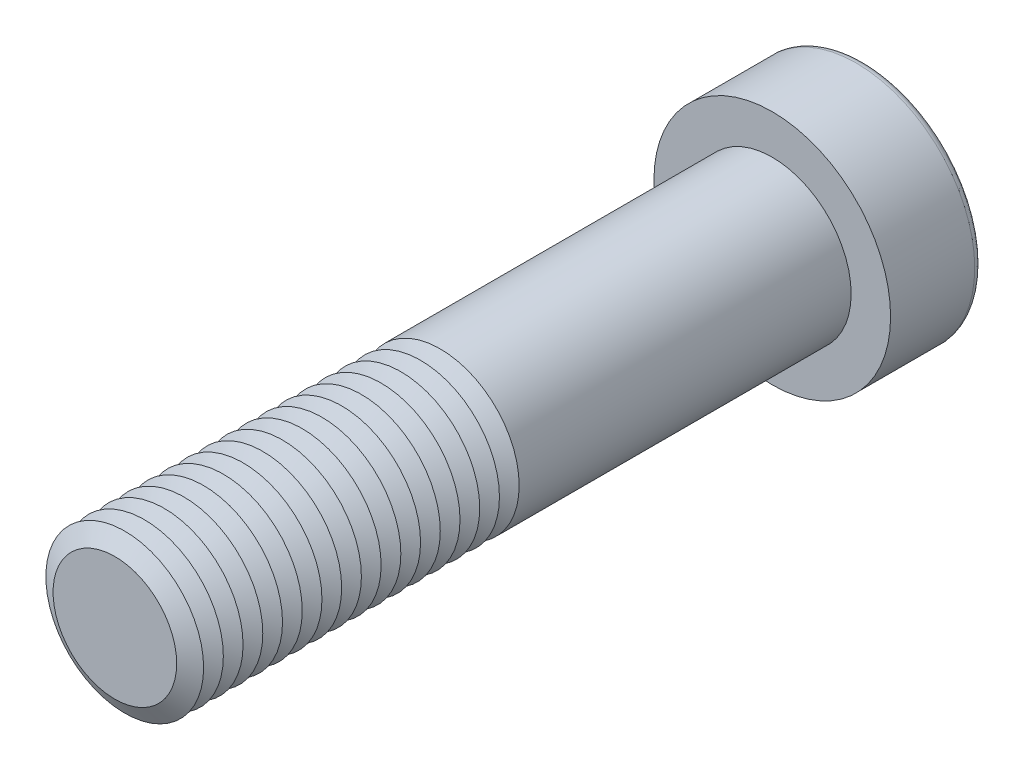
ISO-10303-21;
HEADER;
FILE_DESCRIPTION(('STEP AP214'),'2;1');
FILE_NAME('part.step','',(''),(''),'','','');
FILE_SCHEMA(('AUTOMOTIVE_DESIGN { 1 0 10303 214 1 1 1 1 }'));
ENDSEC;
DATA;
#1=APPLICATION_CONTEXT('core data for automotive mechanical design processes');
#2=APPLICATION_PROTOCOL_DEFINITION('international standard','automotive_design',2000,#1);
#3=PRODUCT_CONTEXT('',#1,'mechanical');
#4=PRODUCT('Part','Part','',(#3));
#5=PRODUCT_RELATED_PRODUCT_CATEGORY('part','',(#4));
#6=PRODUCT_DEFINITION_FORMATION('','',#4);
#7=PRODUCT_DEFINITION_CONTEXT('part definition',#1,'design');
#8=PRODUCT_DEFINITION('design','',#6,#7);
#9=PRODUCT_DEFINITION_SHAPE('','',#8);
#10=(LENGTH_UNIT() NAMED_UNIT(*) SI_UNIT(.MILLI.,.METRE.));
#11=(NAMED_UNIT(*) PLANE_ANGLE_UNIT() SI_UNIT($,.RADIAN.));
#12=(NAMED_UNIT(*) SI_UNIT($,.STERADIAN.) SOLID_ANGLE_UNIT());
#13=UNCERTAINTY_MEASURE_WITH_UNIT(LENGTH_MEASURE(1.E-05),#10,'distance_accuracy_value','');
#14=(GEOMETRIC_REPRESENTATION_CONTEXT(3) GLOBAL_UNCERTAINTY_ASSIGNED_CONTEXT((#13)) GLOBAL_UNIT_ASSIGNED_CONTEXT((#10,
#11,#12)) REPRESENTATION_CONTEXT('',''));
#15=CARTESIAN_POINT('',(0.,0.,0.));
#16=DIRECTION('',(0.,0.,1.));
#17=DIRECTION('',(1.,0.,0.));
#18=AXIS2_PLACEMENT_3D('',#15,#16,#17);
#19=CARTESIAN_POINT('',(0.,0.,89.5));
#20=DIRECTION('',(0.,0.,1.));
#21=DIRECTION('',(1.,0.,0.));
#22=AXIS2_PLACEMENT_3D('',#19,#20,#21);
#23=CONICAL_SURFACE('',#22,12.,1.0471975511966);
#24=CARTESIAN_POINT('',(0.,0.,88.));
#25=DIRECTION('',(0.,0.,1.));
#26=DIRECTION('',(1.,0.,0.));
#27=AXIS2_PLACEMENT_3D('',#24,#25,#26);
#28=CIRCLE('',#27,9.40192378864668);
#29=CARTESIAN_POINT('',(9.40192378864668,0.,88.));
#30=VERTEX_POINT('',#29);
#31=EDGE_CURVE('E313',#30,#30,#28,.T.);
#32=ORIENTED_EDGE('',*,*,#31,.T.);
#33=EDGE_LOOP('',(#32));
#34=FACE_BOUND('',#33,.T.);
#35=CARTESIAN_POINT('',(0.,0.,89.5));
#36=DIRECTION('',(0.,0.,1.));
#37=DIRECTION('',(1.,0.,0.));
#38=AXIS2_PLACEMENT_3D('',#35,#36,#37);
#39=CIRCLE('',#38,12.);
#40=CARTESIAN_POINT('',(12.,0.,89.5));
#41=VERTEX_POINT('',#40);
#42=EDGE_CURVE('E316',#41,#41,#39,.T.);
#43=ORIENTED_EDGE('',*,*,#42,.F.);
#44=EDGE_LOOP('',(#43));
#45=FACE_BOUND('',#44,.T.);
#46=ADVANCED_FACE('F39',(#34,#45),#23,.T.);
#47=CARTESIAN_POINT('',(0.,0.,88.));
#48=DIRECTION('',(0.,0.,-1.));
#49=DIRECTION('',(-1.,0.,0.));
#50=AXIS2_PLACEMENT_3D('',#47,#48,#49);
#51=CONICAL_SURFACE('',#50,9.40192378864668,1.0471975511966);
#52=CARTESIAN_POINT('',(0.,0.,86.5));
#53=DIRECTION('',(0.,0.,1.));
#54=DIRECTION('',(1.,0.,0.));
#55=AXIS2_PLACEMENT_3D('',#52,#53,#54);
#56=CIRCLE('',#55,12.);
#57=CARTESIAN_POINT('',(12.,0.,86.5));
#58=VERTEX_POINT('',#57);
#59=EDGE_CURVE('E324',#58,#58,#56,.T.);
#60=ORIENTED_EDGE('',*,*,#59,.T.);
#61=EDGE_LOOP('',(#60));
#62=FACE_BOUND('',#61,.T.);
#63=ORIENTED_EDGE('',*,*,#31,.F.);
#64=EDGE_LOOP('',(#63));
#65=FACE_BOUND('',#64,.T.);
#66=ADVANCED_FACE('F245',(#62,#65),#51,.T.);
#67=CARTESIAN_POINT('',(0.,0.,100.));
#68=DIRECTION('',(0.,0.,1.));
#69=DIRECTION('',(1.,0.,0.));
#70=AXIS2_PLACEMENT_3D('',#67,#68,#69);
#71=PLANE('',#70);
#72=CARTESIAN_POINT('',(0.,0.,100.));
#73=DIRECTION('',(0.,0.,1.));
#74=DIRECTION('',(1.,0.,0.));
#75=AXIS2_PLACEMENT_3D('',#72,#73,#74);
#76=CIRCLE('',#75,9.40192378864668);
#77=CARTESIAN_POINT('',(9.40192378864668,0.,100.));
#78=VERTEX_POINT('',#77);
#79=EDGE_CURVE('E174',#78,#78,#76,.T.);
#80=ORIENTED_EDGE('',*,*,#79,.T.);
#81=EDGE_LOOP('',(#80));
#82=FACE_BOUND('',#81,.T.);
#83=ADVANCED_FACE('F251',(#82),#71,.T.);
#84=CARTESIAN_POINT('',(0.,0.,100.));
#85=DIRECTION('',(0.,0.,-1.));
#86=DIRECTION('',(-1.,0.,0.));
#87=AXIS2_PLACEMENT_3D('',#84,#85,#86);
#88=CONICAL_SURFACE('',#87,9.40192378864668,1.0471975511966);
#89=CARTESIAN_POINT('',(0.,0.,98.5));
#90=DIRECTION('',(0.,0.,1.));
#91=DIRECTION('',(1.,0.,0.));
#92=AXIS2_PLACEMENT_3D('',#89,#90,#91);
#93=CIRCLE('',#92,12.);
#94=CARTESIAN_POINT('',(12.,0.,98.5));
#95=VERTEX_POINT('',#94);
#96=EDGE_CURVE('E291',#95,#95,#93,.T.);
#97=ORIENTED_EDGE('',*,*,#96,.T.);
#98=EDGE_LOOP('',(#97));
#99=FACE_BOUND('',#98,.T.);
#100=ORIENTED_EDGE('',*,*,#79,.F.);
#101=EDGE_LOOP('',(#100));
#102=FACE_BOUND('',#101,.T.);
#103=ADVANCED_FACE('F199',(#99,#102),#88,.T.);
#104=CARTESIAN_POINT('',(0.,0.,98.5));
#105=DIRECTION('',(0.,0.,1.));
#106=DIRECTION('',(1.,0.,0.));
#107=AXIS2_PLACEMENT_3D('',#104,#105,#106);
#108=CONICAL_SURFACE('',#107,12.,1.0471975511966);
#109=CARTESIAN_POINT('',(0.,0.,97.));
#110=DIRECTION('',(0.,0.,1.));
#111=DIRECTION('',(1.,0.,0.));
#112=AXIS2_PLACEMENT_3D('',#109,#110,#111);
#113=CIRCLE('',#112,9.40192378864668);
#114=CARTESIAN_POINT('',(9.40192378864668,0.,97.));
#115=VERTEX_POINT('',#114);
#116=EDGE_CURVE('E288',#115,#115,#113,.T.);
#117=ORIENTED_EDGE('',*,*,#116,.T.);
#118=EDGE_LOOP('',(#117));
#119=FACE_BOUND('',#118,.T.);
#120=ORIENTED_EDGE('',*,*,#96,.F.);
#121=EDGE_LOOP('',(#120));
#122=FACE_BOUND('',#121,.T.);
#123=ADVANCED_FACE('F277',(#119,#122),#108,.T.);
#124=CARTESIAN_POINT('',(0.,0.,97.));
#125=DIRECTION('',(0.,0.,-1.));
#126=DIRECTION('',(-1.,0.,0.));
#127=AXIS2_PLACEMENT_3D('',#124,#125,#126);
#128=CONICAL_SURFACE('',#127,9.40192378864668,1.0471975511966);
#129=CARTESIAN_POINT('',(0.,0.,95.5));
#130=DIRECTION('',(0.,0.,1.));
#131=DIRECTION('',(1.,0.,0.));
#132=AXIS2_PLACEMENT_3D('',#129,#130,#131);
#133=CIRCLE('',#132,12.);
#134=CARTESIAN_POINT('',(12.,0.,95.5));
#135=VERTEX_POINT('',#134);
#136=EDGE_CURVE('E300',#135,#135,#133,.T.);
#137=ORIENTED_EDGE('',*,*,#136,.T.);
#138=EDGE_LOOP('',(#137));
#139=FACE_BOUND('',#138,.T.);
#140=ORIENTED_EDGE('',*,*,#116,.F.);
#141=EDGE_LOOP('',(#140));
#142=FACE_BOUND('',#141,.T.);
#143=ADVANCED_FACE('F274',(#139,#142),#128,.T.);
#144=CARTESIAN_POINT('',(0.,0.,95.5));
#145=DIRECTION('',(0.,0.,1.));
#146=DIRECTION('',(1.,0.,0.));
#147=AXIS2_PLACEMENT_3D('',#144,#145,#146);
#148=CONICAL_SURFACE('',#147,12.,1.0471975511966);
#149=CARTESIAN_POINT('',(0.,0.,94.));
#150=DIRECTION('',(0.,0.,1.));
#151=DIRECTION('',(1.,0.,0.));
#152=AXIS2_PLACEMENT_3D('',#149,#150,#151);
#153=CIRCLE('',#152,9.40192378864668);
#154=CARTESIAN_POINT('',(9.40192378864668,0.,94.));
#155=VERTEX_POINT('',#154);
#156=EDGE_CURVE('E293',#155,#155,#153,.T.);
#157=ORIENTED_EDGE('',*,*,#156,.T.);
#158=EDGE_LOOP('',(#157));
#159=FACE_BOUND('',#158,.T.);
#160=ORIENTED_EDGE('',*,*,#136,.F.);
#161=EDGE_LOOP('',(#160));
#162=FACE_BOUND('',#161,.T.);
#163=ADVANCED_FACE('F270',(#159,#162),#148,.T.);
#164=CARTESIAN_POINT('',(0.,0.,94.));
#165=DIRECTION('',(0.,0.,-1.));
#166=DIRECTION('',(-1.,0.,0.));
#167=AXIS2_PLACEMENT_3D('',#164,#165,#166);
#168=CONICAL_SURFACE('',#167,9.40192378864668,1.0471975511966);
#169=CARTESIAN_POINT('',(0.,0.,92.5));
#170=DIRECTION('',(0.,0.,1.));
#171=DIRECTION('',(1.,0.,0.));
#172=AXIS2_PLACEMENT_3D('',#169,#170,#171);
#173=CIRCLE('',#172,12.);
#174=CARTESIAN_POINT('',(12.,0.,92.5));
#175=VERTEX_POINT('',#174);
#176=EDGE_CURVE('E310',#175,#175,#173,.T.);
#177=ORIENTED_EDGE('',*,*,#176,.T.);
#178=EDGE_LOOP('',(#177));
#179=FACE_BOUND('',#178,.T.);
#180=ORIENTED_EDGE('',*,*,#156,.F.);
#181=EDGE_LOOP('',(#180));
#182=FACE_BOUND('',#181,.T.);
#183=ADVANCED_FACE('F266',(#179,#182),#168,.T.);
#184=CARTESIAN_POINT('',(0.,0.,92.5));
#185=DIRECTION('',(0.,0.,1.));
#186=DIRECTION('',(1.,0.,0.));
#187=AXIS2_PLACEMENT_3D('',#184,#185,#186);
#188=CONICAL_SURFACE('',#187,12.,1.0471975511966);
#189=CARTESIAN_POINT('',(0.,0.,91.));
#190=DIRECTION('',(0.,0.,1.));
#191=DIRECTION('',(1.,0.,0.));
#192=AXIS2_PLACEMENT_3D('',#189,#190,#191);
#193=CIRCLE('',#192,9.40192378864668);
#194=CARTESIAN_POINT('',(9.40192378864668,0.,91.));
#195=VERTEX_POINT('',#194);
#196=EDGE_CURVE('E306',#195,#195,#193,.T.);
#197=ORIENTED_EDGE('',*,*,#196,.T.);
#198=EDGE_LOOP('',(#197));
#199=FACE_BOUND('',#198,.T.);
#200=ORIENTED_EDGE('',*,*,#176,.F.);
#201=EDGE_LOOP('',(#200));
#202=FACE_BOUND('',#201,.T.);
#203=ADVANCED_FACE('F262',(#199,#202),#188,.T.);
#204=CARTESIAN_POINT('',(0.,0.,91.));
#205=DIRECTION('',(0.,0.,-1.));
#206=DIRECTION('',(-1.,0.,0.));
#207=AXIS2_PLACEMENT_3D('',#204,#205,#206);
#208=CONICAL_SURFACE('',#207,9.40192378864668,1.0471975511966);
#209=ORIENTED_EDGE('',*,*,#42,.T.);
#210=EDGE_LOOP('',(#209));
#211=FACE_BOUND('',#210,.T.);
#212=ORIENTED_EDGE('',*,*,#196,.F.);
#213=EDGE_LOOP('',(#212));
#214=FACE_BOUND('',#213,.T.);
#215=ADVANCED_FACE('F258',(#211,#214),#208,.T.);
#216=CARTESIAN_POINT('',(0.,0.,86.5));
#217=DIRECTION('',(0.,0.,1.));
#218=DIRECTION('',(1.,0.,0.));
#219=AXIS2_PLACEMENT_3D('',#216,#217,#218);
#220=CONICAL_SURFACE('',#219,12.,1.0471975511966);
#221=CARTESIAN_POINT('',(0.,0.,85.));
#222=DIRECTION('',(0.,0.,1.));
#223=DIRECTION('',(1.,0.,0.));
#224=AXIS2_PLACEMENT_3D('',#221,#222,#223);
#225=CIRCLE('',#224,9.40192378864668);
#226=CARTESIAN_POINT('',(9.40192378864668,0.,85.));
#227=VERTEX_POINT('',#226);
#228=EDGE_CURVE('E320',#227,#227,#225,.T.);
#229=ORIENTED_EDGE('',*,*,#228,.T.);
#230=EDGE_LOOP('',(#229));
#231=FACE_BOUND('',#230,.T.);
#232=ORIENTED_EDGE('',*,*,#59,.F.);
#233=EDGE_LOOP('',(#232));
#234=FACE_BOUND('',#233,.T.);
#235=ADVANCED_FACE('F261',(#231,#234),#220,.T.);
#236=CARTESIAN_POINT('',(0.,0.,85.));
#237=DIRECTION('',(0.,0.,-1.));
#238=DIRECTION('',(-1.,0.,0.));
#239=AXIS2_PLACEMENT_3D('',#236,#237,#238);
#240=CONICAL_SURFACE('',#239,9.40192378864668,1.0471975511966);
#241=CARTESIAN_POINT('',(0.,0.,83.5));
#242=DIRECTION('',(0.,0.,1.));
#243=DIRECTION('',(1.,0.,0.));
#244=AXIS2_PLACEMENT_3D('',#241,#242,#243);
#245=CIRCLE('',#244,12.);
#246=CARTESIAN_POINT('',(12.,0.,83.5));
#247=VERTEX_POINT('',#246);
#248=EDGE_CURVE('E332',#247,#247,#245,.T.);
#249=ORIENTED_EDGE('',*,*,#248,.T.);
#250=EDGE_LOOP('',(#249));
#251=FACE_BOUND('',#250,.T.);
#252=ORIENTED_EDGE('',*,*,#228,.F.);
#253=EDGE_LOOP('',(#252));
#254=FACE_BOUND('',#253,.T.);
#255=ADVANCED_FACE('F512',(#251,#254),#240,.T.);
#256=CARTESIAN_POINT('',(0.,0.,83.5));
#257=DIRECTION('',(0.,0.,1.));
#258=DIRECTION('',(1.,0.,0.));
#259=AXIS2_PLACEMENT_3D('',#256,#257,#258);
#260=CONICAL_SURFACE('',#259,12.,1.0471975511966);
#261=CARTESIAN_POINT('',(0.,0.,82.));
#262=DIRECTION('',(0.,0.,1.));
#263=DIRECTION('',(1.,0.,0.));
#264=AXIS2_PLACEMENT_3D('',#261,#262,#263);
#265=CIRCLE('',#264,9.40192378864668);
#266=CARTESIAN_POINT('',(9.40192378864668,0.,82.));
#267=VERTEX_POINT('',#266);
#268=EDGE_CURVE('E328',#267,#267,#265,.T.);
#269=ORIENTED_EDGE('',*,*,#268,.T.);
#270=EDGE_LOOP('',(#269));
#271=FACE_BOUND('',#270,.T.);
#272=ORIENTED_EDGE('',*,*,#248,.F.);
#273=EDGE_LOOP('',(#272));
#274=FACE_BOUND('',#273,.T.);
#275=ADVANCED_FACE('F508',(#271,#274),#260,.T.);
#276=CARTESIAN_POINT('',(0.,0.,82.));
#277=DIRECTION('',(0.,0.,-1.));
#278=DIRECTION('',(-1.,0.,0.));
#279=AXIS2_PLACEMENT_3D('',#276,#277,#278);
#280=CONICAL_SURFACE('',#279,9.40192378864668,1.0471975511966);
#281=CARTESIAN_POINT('',(0.,0.,80.5));
#282=DIRECTION('',(0.,0.,1.));
#283=DIRECTION('',(1.,0.,0.));
#284=AXIS2_PLACEMENT_3D('',#281,#282,#283);
#285=CIRCLE('',#284,12.);
#286=CARTESIAN_POINT('',(12.,0.,80.5));
#287=VERTEX_POINT('',#286);
#288=EDGE_CURVE('E340',#287,#287,#285,.T.);
#289=ORIENTED_EDGE('',*,*,#288,.T.);
#290=EDGE_LOOP('',(#289));
#291=FACE_BOUND('',#290,.T.);
#292=ORIENTED_EDGE('',*,*,#268,.F.);
#293=EDGE_LOOP('',(#292));
#294=FACE_BOUND('',#293,.T.);
#295=ADVANCED_FACE('F504',(#291,#294),#280,.T.);
#296=CARTESIAN_POINT('',(0.,0.,80.5));
#297=DIRECTION('',(0.,0.,1.));
#298=DIRECTION('',(1.,0.,0.));
#299=AXIS2_PLACEMENT_3D('',#296,#297,#298);
#300=CONICAL_SURFACE('',#299,12.,1.0471975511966);
#301=CARTESIAN_POINT('',(0.,0.,79.));
#302=DIRECTION('',(0.,0.,1.));
#303=DIRECTION('',(1.,0.,0.));
#304=AXIS2_PLACEMENT_3D('',#301,#302,#303);
#305=CIRCLE('',#304,9.40192378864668);
#306=CARTESIAN_POINT('',(9.40192378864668,0.,79.));
#307=VERTEX_POINT('',#306);
#308=EDGE_CURVE('E336',#307,#307,#305,.T.);
#309=ORIENTED_EDGE('',*,*,#308,.T.);
#310=EDGE_LOOP('',(#309));
#311=FACE_BOUND('',#310,.T.);
#312=ORIENTED_EDGE('',*,*,#288,.F.);
#313=EDGE_LOOP('',(#312));
#314=FACE_BOUND('',#313,.T.);
#315=ADVANCED_FACE('F500',(#311,#314),#300,.T.);
#316=CARTESIAN_POINT('',(0.,0.,79.));
#317=DIRECTION('',(0.,0.,-1.));
#318=DIRECTION('',(-1.,0.,0.));
#319=AXIS2_PLACEMENT_3D('',#316,#317,#318);
#320=CONICAL_SURFACE('',#319,9.40192378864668,1.0471975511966);
#321=CARTESIAN_POINT('',(0.,0.,77.5));
#322=DIRECTION('',(0.,0.,1.));
#323=DIRECTION('',(1.,0.,0.));
#324=AXIS2_PLACEMENT_3D('',#321,#322,#323);
#325=CIRCLE('',#324,12.);
#326=CARTESIAN_POINT('',(12.,0.,77.5));
#327=VERTEX_POINT('',#326);
#328=EDGE_CURVE('E348',#327,#327,#325,.T.);
#329=ORIENTED_EDGE('',*,*,#328,.T.);
#330=EDGE_LOOP('',(#329));
#331=FACE_BOUND('',#330,.T.);
#332=ORIENTED_EDGE('',*,*,#308,.F.);
#333=EDGE_LOOP('',(#332));
#334=FACE_BOUND('',#333,.T.);
#335=ADVANCED_FACE('F496',(#331,#334),#320,.T.);
#336=CARTESIAN_POINT('',(0.,0.,77.5));
#337=DIRECTION('',(0.,0.,1.));
#338=DIRECTION('',(1.,0.,0.));
#339=AXIS2_PLACEMENT_3D('',#336,#337,#338);
#340=CONICAL_SURFACE('',#339,12.,1.0471975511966);
#341=CARTESIAN_POINT('',(0.,0.,76.));
#342=DIRECTION('',(0.,0.,1.));
#343=DIRECTION('',(1.,0.,0.));
#344=AXIS2_PLACEMENT_3D('',#341,#342,#343);
#345=CIRCLE('',#344,9.40192378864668);
#346=CARTESIAN_POINT('',(9.40192378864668,0.,76.));
#347=VERTEX_POINT('',#346);
#348=EDGE_CURVE('E344',#347,#347,#345,.T.);
#349=ORIENTED_EDGE('',*,*,#348,.T.);
#350=EDGE_LOOP('',(#349));
#351=FACE_BOUND('',#350,.T.);
#352=ORIENTED_EDGE('',*,*,#328,.F.);
#353=EDGE_LOOP('',(#352));
#354=FACE_BOUND('',#353,.T.);
#355=ADVANCED_FACE('F492',(#351,#354),#340,.T.);
#356=CARTESIAN_POINT('',(0.,0.,76.));
#357=DIRECTION('',(0.,0.,-1.));
#358=DIRECTION('',(-1.,0.,0.));
#359=AXIS2_PLACEMENT_3D('',#356,#357,#358);
#360=CONICAL_SURFACE('',#359,9.40192378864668,1.0471975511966);
#361=CARTESIAN_POINT('',(0.,0.,74.5));
#362=DIRECTION('',(0.,0.,1.));
#363=DIRECTION('',(1.,0.,0.));
#364=AXIS2_PLACEMENT_3D('',#361,#362,#363);
#365=CIRCLE('',#364,12.);
#366=CARTESIAN_POINT('',(12.,0.,74.5));
#367=VERTEX_POINT('',#366);
#368=EDGE_CURVE('E356',#367,#367,#365,.T.);
#369=ORIENTED_EDGE('',*,*,#368,.T.);
#370=EDGE_LOOP('',(#369));
#371=FACE_BOUND('',#370,.T.);
#372=ORIENTED_EDGE('',*,*,#348,.F.);
#373=EDGE_LOOP('',(#372));
#374=FACE_BOUND('',#373,.T.);
#375=ADVANCED_FACE('F488',(#371,#374),#360,.T.);
#376=CARTESIAN_POINT('',(0.,0.,74.5));
#377=DIRECTION('',(0.,0.,1.));
#378=DIRECTION('',(1.,0.,0.));
#379=AXIS2_PLACEMENT_3D('',#376,#377,#378);
#380=CONICAL_SURFACE('',#379,12.,1.0471975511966);
#381=CARTESIAN_POINT('',(0.,0.,73.));
#382=DIRECTION('',(0.,0.,1.));
#383=DIRECTION('',(1.,0.,0.));
#384=AXIS2_PLACEMENT_3D('',#381,#382,#383);
#385=CIRCLE('',#384,9.40192378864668);
#386=CARTESIAN_POINT('',(9.40192378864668,0.,73.));
#387=VERTEX_POINT('',#386);
#388=EDGE_CURVE('E352',#387,#387,#385,.T.);
#389=ORIENTED_EDGE('',*,*,#388,.T.);
#390=EDGE_LOOP('',(#389));
#391=FACE_BOUND('',#390,.T.);
#392=ORIENTED_EDGE('',*,*,#368,.F.);
#393=EDGE_LOOP('',(#392));
#394=FACE_BOUND('',#393,.T.);
#395=ADVANCED_FACE('F484',(#391,#394),#380,.T.);
#396=CARTESIAN_POINT('',(0.,0.,73.));
#397=DIRECTION('',(0.,0.,-1.));
#398=DIRECTION('',(-1.,0.,0.));
#399=AXIS2_PLACEMENT_3D('',#396,#397,#398);
#400=CONICAL_SURFACE('',#399,9.40192378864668,1.0471975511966);
#401=CARTESIAN_POINT('',(0.,0.,71.5));
#402=DIRECTION('',(0.,0.,1.));
#403=DIRECTION('',(1.,0.,0.));
#404=AXIS2_PLACEMENT_3D('',#401,#402,#403);
#405=CIRCLE('',#404,12.);
#406=CARTESIAN_POINT('',(12.,0.,71.5));
#407=VERTEX_POINT('',#406);
#408=EDGE_CURVE('E364',#407,#407,#405,.T.);
#409=ORIENTED_EDGE('',*,*,#408,.T.);
#410=EDGE_LOOP('',(#409));
#411=FACE_BOUND('',#410,.T.);
#412=ORIENTED_EDGE('',*,*,#388,.F.);
#413=EDGE_LOOP('',(#412));
#414=FACE_BOUND('',#413,.T.);
#415=ADVANCED_FACE('F480',(#411,#414),#400,.T.);
#416=CARTESIAN_POINT('',(0.,0.,71.5));
#417=DIRECTION('',(0.,0.,1.));
#418=DIRECTION('',(1.,0.,0.));
#419=AXIS2_PLACEMENT_3D('',#416,#417,#418);
#420=CONICAL_SURFACE('',#419,12.,1.0471975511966);
#421=CARTESIAN_POINT('',(0.,0.,70.));
#422=DIRECTION('',(0.,0.,1.));
#423=DIRECTION('',(1.,0.,0.));
#424=AXIS2_PLACEMENT_3D('',#421,#422,#423);
#425=CIRCLE('',#424,9.40192378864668);
#426=CARTESIAN_POINT('',(9.40192378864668,0.,70.));
#427=VERTEX_POINT('',#426);
#428=EDGE_CURVE('E360',#427,#427,#425,.T.);
#429=ORIENTED_EDGE('',*,*,#428,.T.);
#430=EDGE_LOOP('',(#429));
#431=FACE_BOUND('',#430,.T.);
#432=ORIENTED_EDGE('',*,*,#408,.F.);
#433=EDGE_LOOP('',(#432));
#434=FACE_BOUND('',#433,.T.);
#435=ADVANCED_FACE('F476',(#431,#434),#420,.T.);
#436=CARTESIAN_POINT('',(0.,0.,70.));
#437=DIRECTION('',(0.,0.,-1.));
#438=DIRECTION('',(-1.,0.,0.));
#439=AXIS2_PLACEMENT_3D('',#436,#437,#438);
#440=CONICAL_SURFACE('',#439,9.40192378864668,1.0471975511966);
#441=CARTESIAN_POINT('',(0.,0.,68.5));
#442=DIRECTION('',(0.,0.,1.));
#443=DIRECTION('',(1.,0.,0.));
#444=AXIS2_PLACEMENT_3D('',#441,#442,#443);
#445=CIRCLE('',#444,12.);
#446=CARTESIAN_POINT('',(12.,0.,68.5));
#447=VERTEX_POINT('',#446);
#448=EDGE_CURVE('E371',#447,#447,#445,.T.);
#449=ORIENTED_EDGE('',*,*,#448,.T.);
#450=EDGE_LOOP('',(#449));
#451=FACE_BOUND('',#450,.T.);
#452=ORIENTED_EDGE('',*,*,#428,.F.);
#453=EDGE_LOOP('',(#452));
#454=FACE_BOUND('',#453,.T.);
#455=ADVANCED_FACE('F472',(#451,#454),#440,.T.);
#456=CARTESIAN_POINT('',(0.,0.,68.5));
#457=DIRECTION('',(0.,0.,1.));
#458=DIRECTION('',(1.,0.,0.));
#459=AXIS2_PLACEMENT_3D('',#456,#457,#458);
#460=CONICAL_SURFACE('',#459,12.,1.0471975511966);
#461=CARTESIAN_POINT('',(0.,0.,67.));
#462=DIRECTION('',(0.,0.,1.));
#463=DIRECTION('',(1.,0.,0.));
#464=AXIS2_PLACEMENT_3D('',#461,#462,#463);
#465=CIRCLE('',#464,9.40192378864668);
#466=CARTESIAN_POINT('',(9.40192378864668,0.,67.));
#467=VERTEX_POINT('',#466);
#468=EDGE_CURVE('E368',#467,#467,#465,.T.);
#469=ORIENTED_EDGE('',*,*,#468,.T.);
#470=EDGE_LOOP('',(#469));
#471=FACE_BOUND('',#470,.T.);
#472=ORIENTED_EDGE('',*,*,#448,.F.);
#473=EDGE_LOOP('',(#472));
#474=FACE_BOUND('',#473,.T.);
#475=ADVANCED_FACE('F468',(#471,#474),#460,.T.);
#476=CARTESIAN_POINT('',(0.,0.,67.));
#477=DIRECTION('',(0.,0.,-1.));
#478=DIRECTION('',(-1.,0.,0.));
#479=AXIS2_PLACEMENT_3D('',#476,#477,#478);
#480=CONICAL_SURFACE('',#479,9.40192378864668,1.0471975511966);
#481=CARTESIAN_POINT('',(0.,0.,65.5));
#482=DIRECTION('',(0.,0.,1.));
#483=DIRECTION('',(1.,0.,0.));
#484=AXIS2_PLACEMENT_3D('',#481,#482,#483);
#485=CIRCLE('',#484,12.);
#486=CARTESIAN_POINT('',(12.,0.,65.5));
#487=VERTEX_POINT('',#486);
#488=EDGE_CURVE('E379',#487,#487,#485,.T.);
#489=ORIENTED_EDGE('',*,*,#488,.T.);
#490=EDGE_LOOP('',(#489));
#491=FACE_BOUND('',#490,.T.);
#492=ORIENTED_EDGE('',*,*,#468,.F.);
#493=EDGE_LOOP('',(#492));
#494=FACE_BOUND('',#493,.T.);
#495=ADVANCED_FACE('F464',(#491,#494),#480,.T.);
#496=CARTESIAN_POINT('',(0.,0.,65.5));
#497=DIRECTION('',(0.,0.,1.));
#498=DIRECTION('',(1.,0.,0.));
#499=AXIS2_PLACEMENT_3D('',#496,#497,#498);
#500=CONICAL_SURFACE('',#499,12.,1.0471975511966);
#501=CARTESIAN_POINT('',(0.,0.,64.));
#502=DIRECTION('',(0.,0.,1.));
#503=DIRECTION('',(1.,0.,0.));
#504=AXIS2_PLACEMENT_3D('',#501,#502,#503);
#505=CIRCLE('',#504,9.40192378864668);
#506=CARTESIAN_POINT('',(9.40192378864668,0.,64.));
#507=VERTEX_POINT('',#506);
#508=EDGE_CURVE('E375',#507,#507,#505,.T.);
#509=ORIENTED_EDGE('',*,*,#508,.T.);
#510=EDGE_LOOP('',(#509));
#511=FACE_BOUND('',#510,.T.);
#512=ORIENTED_EDGE('',*,*,#488,.F.);
#513=EDGE_LOOP('',(#512));
#514=FACE_BOUND('',#513,.T.);
#515=ADVANCED_FACE('F460',(#511,#514),#500,.T.);
#516=CARTESIAN_POINT('',(0.,0.,64.));
#517=DIRECTION('',(0.,0.,-1.));
#518=DIRECTION('',(-1.,0.,0.));
#519=AXIS2_PLACEMENT_3D('',#516,#517,#518);
#520=CONICAL_SURFACE('',#519,9.40192378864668,1.0471975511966);
#521=CARTESIAN_POINT('',(0.,0.,62.5));
#522=DIRECTION('',(0.,0.,1.));
#523=DIRECTION('',(1.,0.,0.));
#524=AXIS2_PLACEMENT_3D('',#521,#522,#523);
#525=CIRCLE('',#524,12.);
#526=CARTESIAN_POINT('',(12.,0.,62.5));
#527=VERTEX_POINT('',#526);
#528=EDGE_CURVE('E387',#527,#527,#525,.T.);
#529=ORIENTED_EDGE('',*,*,#528,.T.);
#530=EDGE_LOOP('',(#529));
#531=FACE_BOUND('',#530,.T.);
#532=ORIENTED_EDGE('',*,*,#508,.F.);
#533=EDGE_LOOP('',(#532));
#534=FACE_BOUND('',#533,.T.);
#535=ADVANCED_FACE('F456',(#531,#534),#520,.T.);
#536=CARTESIAN_POINT('',(0.,0.,62.5));
#537=DIRECTION('',(0.,0.,1.));
#538=DIRECTION('',(1.,0.,0.));
#539=AXIS2_PLACEMENT_3D('',#536,#537,#538);
#540=CONICAL_SURFACE('',#539,12.,1.0471975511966);
#541=CARTESIAN_POINT('',(0.,0.,61.));
#542=DIRECTION('',(0.,0.,1.));
#543=DIRECTION('',(1.,0.,0.));
#544=AXIS2_PLACEMENT_3D('',#541,#542,#543);
#545=CIRCLE('',#544,9.40192378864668);
#546=CARTESIAN_POINT('',(9.40192378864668,0.,61.));
#547=VERTEX_POINT('',#546);
#548=EDGE_CURVE('E383',#547,#547,#545,.T.);
#549=ORIENTED_EDGE('',*,*,#548,.T.);
#550=EDGE_LOOP('',(#549));
#551=FACE_BOUND('',#550,.T.);
#552=ORIENTED_EDGE('',*,*,#528,.F.);
#553=EDGE_LOOP('',(#552));
#554=FACE_BOUND('',#553,.T.);
#555=ADVANCED_FACE('F452',(#551,#554),#540,.T.);
#556=CARTESIAN_POINT('',(0.,0.,61.));
#557=DIRECTION('',(0.,0.,-1.));
#558=DIRECTION('',(-1.,0.,0.));
#559=AXIS2_PLACEMENT_3D('',#556,#557,#558);
#560=CONICAL_SURFACE('',#559,9.40192378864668,1.0471975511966);
#561=CARTESIAN_POINT('',(0.,0.,59.5));
#562=DIRECTION('',(0.,0.,1.));
#563=DIRECTION('',(1.,0.,0.));
#564=AXIS2_PLACEMENT_3D('',#561,#562,#563);
#565=CIRCLE('',#564,12.);
#566=CARTESIAN_POINT('',(12.,0.,59.5));
#567=VERTEX_POINT('',#566);
#568=EDGE_CURVE('E395',#567,#567,#565,.T.);
#569=ORIENTED_EDGE('',*,*,#568,.T.);
#570=EDGE_LOOP('',(#569));
#571=FACE_BOUND('',#570,.T.);
#572=ORIENTED_EDGE('',*,*,#548,.F.);
#573=EDGE_LOOP('',(#572));
#574=FACE_BOUND('',#573,.T.);
#575=ADVANCED_FACE('F448',(#571,#574),#560,.T.);
#576=CARTESIAN_POINT('',(0.,0.,59.5));
#577=DIRECTION('',(0.,0.,1.));
#578=DIRECTION('',(1.,0.,0.));
#579=AXIS2_PLACEMENT_3D('',#576,#577,#578);
#580=CONICAL_SURFACE('',#579,12.,1.0471975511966);
#581=CARTESIAN_POINT('',(0.,0.,58.));
#582=DIRECTION('',(0.,0.,1.));
#583=DIRECTION('',(1.,0.,0.));
#584=AXIS2_PLACEMENT_3D('',#581,#582,#583);
#585=CIRCLE('',#584,9.40192378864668);
#586=CARTESIAN_POINT('',(9.40192378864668,0.,58.));
#587=VERTEX_POINT('',#586);
#588=EDGE_CURVE('E391',#587,#587,#585,.T.);
#589=ORIENTED_EDGE('',*,*,#588,.T.);
#590=EDGE_LOOP('',(#589));
#591=FACE_BOUND('',#590,.T.);
#592=ORIENTED_EDGE('',*,*,#568,.F.);
#593=EDGE_LOOP('',(#592));
#594=FACE_BOUND('',#593,.T.);
#595=ADVANCED_FACE('F444',(#591,#594),#580,.T.);
#596=CARTESIAN_POINT('',(0.,0.,58.));
#597=DIRECTION('',(0.,0.,-1.));
#598=DIRECTION('',(-1.,0.,0.));
#599=AXIS2_PLACEMENT_3D('',#596,#597,#598);
#600=CONICAL_SURFACE('',#599,9.40192378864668,1.0471975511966);
#601=CARTESIAN_POINT('',(0.,0.,56.5));
#602=DIRECTION('',(0.,0.,1.));
#603=DIRECTION('',(1.,0.,0.));
#604=AXIS2_PLACEMENT_3D('',#601,#602,#603);
#605=CIRCLE('',#604,12.);
#606=CARTESIAN_POINT('',(12.,0.,56.5));
#607=VERTEX_POINT('',#606);
#608=EDGE_CURVE('E403',#607,#607,#605,.T.);
#609=ORIENTED_EDGE('',*,*,#608,.T.);
#610=EDGE_LOOP('',(#609));
#611=FACE_BOUND('',#610,.T.);
#612=ORIENTED_EDGE('',*,*,#588,.F.);
#613=EDGE_LOOP('',(#612));
#614=FACE_BOUND('',#613,.T.);
#615=ADVANCED_FACE('F440',(#611,#614),#600,.T.);
#616=CARTESIAN_POINT('',(0.,0.,56.5));
#617=DIRECTION('',(0.,0.,1.));
#618=DIRECTION('',(1.,0.,0.));
#619=AXIS2_PLACEMENT_3D('',#616,#617,#618);
#620=CONICAL_SURFACE('',#619,12.,1.0471975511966);
#621=CARTESIAN_POINT('',(0.,0.,55.));
#622=DIRECTION('',(0.,0.,1.));
#623=DIRECTION('',(1.,0.,0.));
#624=AXIS2_PLACEMENT_3D('',#621,#622,#623);
#625=CIRCLE('',#624,9.40192378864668);
#626=CARTESIAN_POINT('',(9.40192378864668,0.,55.));
#627=VERTEX_POINT('',#626);
#628=EDGE_CURVE('E399',#627,#627,#625,.T.);
#629=ORIENTED_EDGE('',*,*,#628,.T.);
#630=EDGE_LOOP('',(#629));
#631=FACE_BOUND('',#630,.T.);
#632=ORIENTED_EDGE('',*,*,#608,.F.);
#633=EDGE_LOOP('',(#632));
#634=FACE_BOUND('',#633,.T.);
#635=ADVANCED_FACE('F435',(#631,#634),#620,.T.);
#636=CARTESIAN_POINT('',(0.,0.,55.));
#637=DIRECTION('',(0.,0.,-1.));
#638=DIRECTION('',(-1.,0.,0.));
#639=AXIS2_PLACEMENT_3D('',#636,#637,#638);
#640=CONICAL_SURFACE('',#639,9.40192378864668,1.0471975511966);
#641=CARTESIAN_POINT('',(0.,0.,53.5));
#642=DIRECTION('',(0.,0.,1.));
#643=DIRECTION('',(1.,0.,0.));
#644=AXIS2_PLACEMENT_3D('',#641,#642,#643);
#645=CIRCLE('',#644,12.);
#646=CARTESIAN_POINT('',(12.,0.,53.5));
#647=VERTEX_POINT('',#646);
#648=EDGE_CURVE('E415',#647,#647,#645,.T.);
#649=ORIENTED_EDGE('',*,*,#648,.T.);
#650=EDGE_LOOP('',(#649));
#651=FACE_BOUND('',#650,.T.);
#652=ORIENTED_EDGE('',*,*,#628,.F.);
#653=EDGE_LOOP('',(#652));
#654=FACE_BOUND('',#653,.T.);
#655=ADVANCED_FACE('F421',(#651,#654),#640,.T.);
#656=CARTESIAN_POINT('',(0.,0.,53.5));
#657=DIRECTION('',(0.,0.,1.));
#658=DIRECTION('',(1.,0.,0.));
#659=AXIS2_PLACEMENT_3D('',#656,#657,#658);
#660=CONICAL_SURFACE('',#659,12.,1.0471975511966);
#661=CARTESIAN_POINT('',(0.,0.,52.));
#662=DIRECTION('',(0.,0.,1.));
#663=DIRECTION('',(1.,0.,0.));
#664=AXIS2_PLACEMENT_3D('',#661,#662,#663);
#665=CIRCLE('',#664,9.40192378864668);
#666=CARTESIAN_POINT('',(9.40192378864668,0.,52.));
#667=VERTEX_POINT('',#666);
#668=EDGE_CURVE('E407',#667,#667,#665,.T.);
#669=ORIENTED_EDGE('',*,*,#668,.T.);
#670=EDGE_LOOP('',(#669));
#671=FACE_BOUND('',#670,.T.);
#672=ORIENTED_EDGE('',*,*,#648,.F.);
#673=EDGE_LOOP('',(#672));
#674=FACE_BOUND('',#673,.T.);
#675=ADVANCED_FACE('F424',(#671,#674),#660,.T.);
#676=CARTESIAN_POINT('',(0.,0.,52.));
#677=DIRECTION('',(0.,0.,-1.));
#678=DIRECTION('',(-1.,0.,0.));
#679=AXIS2_PLACEMENT_3D('',#676,#677,#678);
#680=CONICAL_SURFACE('',#679,9.40192378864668,1.0471975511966);
#681=CARTESIAN_POINT('',(0.,0.,50.5));
#682=DIRECTION('',(0.,0.,1.));
#683=DIRECTION('',(1.,0.,0.));
#684=AXIS2_PLACEMENT_3D('',#681,#682,#683);
#685=CIRCLE('',#684,12.);
#686=CARTESIAN_POINT('',(12.,0.,50.5));
#687=VERTEX_POINT('',#686);
#688=EDGE_CURVE('E411',#687,#687,#685,.T.);
#689=ORIENTED_EDGE('',*,*,#688,.T.);
#690=EDGE_LOOP('',(#689));
#691=FACE_BOUND('',#690,.T.);
#692=ORIENTED_EDGE('',*,*,#668,.F.);
#693=EDGE_LOOP('',(#692));
#694=FACE_BOUND('',#693,.T.);
#695=ADVANCED_FACE('F426',(#691,#694),#680,.T.);
#696=CARTESIAN_POINT('',(0.,0.,0.25));
#697=DIRECTION('',(0.,0.,-1.));
#698=DIRECTION('',(-1.,0.,0.));
#699=AXIS2_PLACEMENT_3D('',#696,#697,#698);
#700=CONICAL_SURFACE('',#699,9.5,1.0471975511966);
#701=CARTESIAN_POINT('',(0.,0.,5.73482755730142));
#702=VERTEX_POINT('',#701);
#703=VERTEX_LOOP('',#702);
#704=FACE_BOUND('',#703,.T.);
#705=CARTESIAN_POINT('',(0.,0.,0.25));
#706=DIRECTION('',(0.,0.,-1.));
#707=DIRECTION('',(-1.,0.,0.));
#708=AXIS2_PLACEMENT_3D('',#705,#706,#707);
#709=CIRCLE('',#708,9.5);
#710=CARTESIAN_POINT('',(-8.22724133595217,4.75,0.25));
#711=VERTEX_POINT('',#710);
#712=CARTESIAN_POINT('',(0.,9.5,0.25));
#713=VERTEX_POINT('',#712);
#714=EDGE_CURVE('E149',#711,#713,#709,.T.);
#715=ORIENTED_EDGE('',*,*,#714,.T.);
#716=CARTESIAN_POINT('',(0.,0.,0.25));
#717=DIRECTION('',(0.,0.,-1.));
#718=DIRECTION('',(-1.,0.,0.));
#719=AXIS2_PLACEMENT_3D('',#716,#717,#718);
#720=CIRCLE('',#719,9.5);
#721=CARTESIAN_POINT('',(8.22724133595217,4.75,0.25));
#722=VERTEX_POINT('',#721);
#723=EDGE_CURVE('E54',#713,#722,#720,.T.);
#724=ORIENTED_EDGE('',*,*,#723,.T.);
#725=CARTESIAN_POINT('',(8.22724133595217,-4.75,0.25));
#726=VERTEX_POINT('',#725);
#727=EDGE_CURVE('E1028',#722,#726,#720,.T.);
#728=ORIENTED_EDGE('',*,*,#727,.T.);
#729=CARTESIAN_POINT('',(0.,-9.5,0.25));
#730=VERTEX_POINT('',#729);
#731=EDGE_CURVE('E1026',#726,#730,#720,.T.);
#732=ORIENTED_EDGE('',*,*,#731,.T.);
#733=CARTESIAN_POINT('',(-8.22724133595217,-4.75,0.25));
#734=VERTEX_POINT('',#733);
#735=EDGE_CURVE('E1020',#730,#734,#720,.T.);
#736=ORIENTED_EDGE('',*,*,#735,.T.);
#737=EDGE_CURVE('E1018',#734,#711,#720,.T.);
#738=ORIENTED_EDGE('',*,*,#737,.T.);
#739=EDGE_LOOP('',(#715,#724,#728,#732,#736,#738));
#740=FACE_BOUND('',#739,.T.);
#741=ADVANCED_FACE('F201',(#704,#740),#700,.F.);
#742=CARTESIAN_POINT('',(0.,0.,0.25));
#743=DIRECTION('',(0.,0.,-1.));
#744=DIRECTION('',(-1.,0.,0.));
#745=AXIS2_PLACEMENT_3D('',#742,#743,#744);
#746=PLANE('',#745);
#747=ORIENTED_EDGE('',*,*,#723,.F.);
#748=DIRECTION('',(1.,0.,0.));
#749=VECTOR('',#748,1.);
#750=CARTESIAN_POINT('',(-5.48482755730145,9.5,0.25));
#751=LINE('',#750,#749);
#752=CARTESIAN_POINT('',(5.48482755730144,9.5,0.25));
#753=VERTEX_POINT('',#752);
#754=EDGE_CURVE('E1066',#713,#753,#751,.T.);
#755=ORIENTED_EDGE('',*,*,#754,.T.);
#756=DIRECTION('',(0.5,-0.866025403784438,0.));
#757=VECTOR('',#756,1.);
#758=CARTESIAN_POINT('',(5.48482755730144,9.5,0.25));
#759=LINE('',#758,#757);
#760=EDGE_CURVE('E155',#753,#722,#759,.T.);
#761=ORIENTED_EDGE('',*,*,#760,.T.);
#762=EDGE_LOOP('',(#747,#755,#761));
#763=FACE_BOUND('',#762,.T.);
#764=ADVANCED_FACE('F607',(#763),#746,.T.);
#765=ORIENTED_EDGE('',*,*,#727,.F.);
#766=CARTESIAN_POINT('',(10.9696551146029,0.,0.25));
#767=VERTEX_POINT('',#766);
#768=EDGE_CURVE('E1065',#722,#767,#759,.T.);
#769=ORIENTED_EDGE('',*,*,#768,.T.);
#770=DIRECTION('',(-0.5,-0.866025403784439,0.));
#771=VECTOR('',#770,1.);
#772=CARTESIAN_POINT('',(10.9696551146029,0.,0.25));
#773=LINE('',#772,#771);
#774=EDGE_CURVE('E1042',#767,#726,#773,.T.);
#775=ORIENTED_EDGE('',*,*,#774,.T.);
#776=EDGE_LOOP('',(#765,#769,#775));
#777=FACE_BOUND('',#776,.T.);
#778=ADVANCED_FACE('F617',(#777),#746,.T.);
#779=ORIENTED_EDGE('',*,*,#731,.F.);
#780=CARTESIAN_POINT('',(5.48482755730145,-9.5,0.25));
#781=VERTEX_POINT('',#780);
#782=EDGE_CURVE('E1044',#726,#781,#773,.T.);
#783=ORIENTED_EDGE('',*,*,#782,.T.);
#784=DIRECTION('',(-1.,0.,0.));
#785=VECTOR('',#784,1.);
#786=CARTESIAN_POINT('',(5.48482755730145,-9.5,0.25));
#787=LINE('',#786,#785);
#788=EDGE_CURVE('E993',#781,#730,#787,.T.);
#789=ORIENTED_EDGE('',*,*,#788,.T.);
#790=EDGE_LOOP('',(#779,#783,#789));
#791=FACE_BOUND('',#790,.T.);
#792=ADVANCED_FACE('F627',(#791),#746,.T.);
#793=ORIENTED_EDGE('',*,*,#735,.F.);
#794=CARTESIAN_POINT('',(-5.48482755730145,-9.5,0.25));
#795=VERTEX_POINT('',#794);
#796=EDGE_CURVE('E1038',#730,#795,#787,.T.);
#797=ORIENTED_EDGE('',*,*,#796,.T.);
#798=DIRECTION('',(-0.5,0.866025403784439,0.));
#799=VECTOR('',#798,1.);
#800=CARTESIAN_POINT('',(-5.48482755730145,-9.5,0.25));
#801=LINE('',#800,#799);
#802=EDGE_CURVE('E1040',#795,#734,#801,.T.);
#803=ORIENTED_EDGE('',*,*,#802,.T.);
#804=EDGE_LOOP('',(#793,#797,#803));
#805=FACE_BOUND('',#804,.T.);
#806=ADVANCED_FACE('F635',(#805),#746,.T.);
#807=ORIENTED_EDGE('',*,*,#737,.F.);
#808=CARTESIAN_POINT('',(-10.9696551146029,0.,0.25));
#809=VERTEX_POINT('',#808);
#810=EDGE_CURVE('E1045',#734,#809,#801,.T.);
#811=ORIENTED_EDGE('',*,*,#810,.T.);
#812=DIRECTION('',(0.5,0.866025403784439,0.));
#813=VECTOR('',#812,1.);
#814=CARTESIAN_POINT('',(-10.9696551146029,0.,0.25));
#815=LINE('',#814,#813);
#816=EDGE_CURVE('E158',#809,#711,#815,.T.);
#817=ORIENTED_EDGE('',*,*,#816,.T.);
#818=EDGE_LOOP('',(#807,#811,#817));
#819=FACE_BOUND('',#818,.T.);
#820=ADVANCED_FACE('F231',(#819),#746,.T.);
#821=ORIENTED_EDGE('',*,*,#714,.F.);
#822=CARTESIAN_POINT('',(-5.48482755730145,9.5,0.25));
#823=VERTEX_POINT('',#822);
#824=EDGE_CURVE('E1050',#711,#823,#815,.T.);
#825=ORIENTED_EDGE('',*,*,#824,.T.);
#826=EDGE_CURVE('E1064',#823,#713,#751,.T.);
#827=ORIENTED_EDGE('',*,*,#826,.T.);
#828=EDGE_LOOP('',(#821,#825,#827));
#829=FACE_BOUND('',#828,.T.);
#830=ADVANCED_FACE('F619',(#829),#746,.T.);
#831=CARTESIAN_POINT('',(-5.48482755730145,9.5,0.25));
#832=DIRECTION('',(0.,1.,0.));
#833=DIRECTION('',(0.,0.,1.));
#834=AXIS2_PLACEMENT_3D('',#831,#832,#833);
#835=PLANE('',#834);
#836=DIRECTION('',(0.,0.,-1.));
#837=VECTOR('',#836,1.);
#838=CARTESIAN_POINT('',(-5.48482755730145,9.5,0.25));
#839=LINE('',#838,#837);
#840=CARTESIAN_POINT('',(-5.48482755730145,9.5,-14.));
#841=VERTEX_POINT('',#840);
#842=EDGE_CURVE('E147',#823,#841,#839,.T.);
#843=ORIENTED_EDGE('',*,*,#842,.T.);
#844=CARTESIAN_POINT('',(-14.3184360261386,9.5,-15.6649552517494));
#845=CARTESIAN_POINT('',(-13.8894653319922,9.5,-15.5692031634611));
#846=CARTESIAN_POINT('',(-13.460220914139,9.5,-15.4746548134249));
#847=CARTESIAN_POINT('',(-12.6010505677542,9.5,-15.2886152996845));
#848=CARTESIAN_POINT('',(-12.1711246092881,9.5,-15.1971242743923));
#849=CARTESIAN_POINT('',(-11.3100507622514,9.5,-15.0177651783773));
#850=CARTESIAN_POINT('',(-10.8789020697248,9.5,-14.9299009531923));
#851=CARTESIAN_POINT('',(-10.0156929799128,9.5,-14.7587741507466));
#852=CARTESIAN_POINT('',(-9.5836325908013,9.5,-14.67551153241));
#853=CARTESIAN_POINT('',(-8.72220045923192,9.5,-14.5153788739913));
#854=CARTESIAN_POINT('',(-8.29283790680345,9.5,-14.4384596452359));
#855=CARTESIAN_POINT('',(-7.43292010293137,9.5,-14.2915458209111));
#856=CARTESIAN_POINT('',(-7.0023648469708,9.5,-14.2215512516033));
#857=CARTESIAN_POINT('',(-6.14001360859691,9.5,-14.0901048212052));
#858=CARTESIAN_POINT('',(-5.70821784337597,9.5,-14.0286515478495));
#859=CARTESIAN_POINT('',(-4.84325961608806,9.5,-13.9161318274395));
#860=CARTESIAN_POINT('',(-4.41009715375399,9.5,-13.8650653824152));
#861=CARTESIAN_POINT('',(-3.53757113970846,9.5,-13.7748018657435));
#862=CARTESIAN_POINT('',(-3.09819281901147,9.5,-13.7357454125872));
#863=CARTESIAN_POINT('',(-2.2183738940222,9.5,-13.6722240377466));
#864=CARTESIAN_POINT('',(-1.77793331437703,9.5,-13.6477587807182));
#865=CARTESIAN_POINT('',(-0.896631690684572,9.5,-13.6148480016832));
#866=CARTESIAN_POINT('',(-0.455770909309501,9.5,-13.606395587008));
#867=CARTESIAN_POINT('',(0.425958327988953,9.5,-13.606024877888));
#868=CARTESIAN_POINT('',(0.866826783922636,9.5,-13.614106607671));
#869=CARTESIAN_POINT('',(1.74977048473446,9.5,-13.6463580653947));
#870=CARTESIAN_POINT('',(2.1918432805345,9.5,-13.6705935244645));
#871=CARTESIAN_POINT('',(3.07492453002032,9.5,-13.7337958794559));
#872=CARTESIAN_POINT('',(3.5159329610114,9.5,-13.7727630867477));
#873=CARTESIAN_POINT('',(4.39689734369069,9.5,-13.8635087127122));
#874=CARTESIAN_POINT('',(4.83685243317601,9.5,-13.9152953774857));
#875=CARTESIAN_POINT('',(5.71535222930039,9.5,-14.0295826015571));
#876=CARTESIAN_POINT('',(6.15389693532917,9.5,-14.0920831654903));
#877=CARTESIAN_POINT('',(7.04109045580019,9.5,-14.2276023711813));
#878=CARTESIAN_POINT('',(7.48970345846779,9.5,-14.3008534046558));
#879=CARTESIAN_POINT('',(8.38565999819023,9.5,-14.4547834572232));
#880=CARTESIAN_POINT('',(8.83300349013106,9.5,-14.5354627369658));
#881=CARTESIAN_POINT('',(9.72662836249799,9.5,-14.7027801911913));
#882=CARTESIAN_POINT('',(10.1729095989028,9.5,-14.7894191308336));
#883=CARTESIAN_POINT('',(11.0645098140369,9.5,-14.9674686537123));
#884=CARTESIAN_POINT('',(11.5098288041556,9.5,-15.0588791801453));
#885=CARTESIAN_POINT('',(12.3998049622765,9.5,-15.2455765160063));
#886=CARTESIAN_POINT('',(12.8444618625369,9.5,-15.3408645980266));
#887=CARTESIAN_POINT('',(13.7330947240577,9.5,-15.5345693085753));
#888=CARTESIAN_POINT('',(14.1770706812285,9.5,-15.6329859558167));
#889=CARTESIAN_POINT('',(15.5080689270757,9.5,-15.9320263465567));
#890=CARTESIAN_POINT('',(16.3942355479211,9.5,-16.1364562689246));
#891=CARTESIAN_POINT('',(18.1541693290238,9.5,-16.5497091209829));
#892=CARTESIAN_POINT('',(19.0279562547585,9.5,-16.7584484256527));
#893=CARTESIAN_POINT('',(20.7743818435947,9.5,-17.180754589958));
#894=CARTESIAN_POINT('',(21.647020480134,9.5,-17.3943215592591));
#895=CARTESIAN_POINT('',(23.3902098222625,9.5,-17.8246823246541));
#896=CARTESIAN_POINT('',(24.2607617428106,9.5,-18.0414712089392));
#897=CARTESIAN_POINT('',(25.5660757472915,9.5,-18.3686360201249));
#898=CARTESIAN_POINT('',(26.0010870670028,9.5,-18.4780192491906));
#899=CARTESIAN_POINT('',(26.8709622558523,9.5,-18.6973688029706));
#900=CARTESIAN_POINT('',(27.3058261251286,9.5,-18.8073351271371));
#901=CARTESIAN_POINT('',(27.7406260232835,9.5,-18.9175537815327));
#902=B_SPLINE_CURVE_WITH_KNOTS('',3,(#844,#845,#846,#847,#848,#849,#850,#851,#852,#853,#854,
#855,#856,#857,#858,#859,#860,#861,#862,#863,#864,#865,#866,#867,#868,#869,#870,#871,#872,#873,
#874,#875,#876,#877,#878,#879,#880,#881,#882,#883,#884,#885,#886,#887,#888,#889,#890,#891,#892,
#893,#894,#895,#896,#897,#898,#899,#900,#901),.UNSPECIFIED.,.F.,.F.,(4,2,2,2,2,2,2,2,2,2,2,2,2,
2,2,2,2,2,2,2,2,2,2,2,2,2,2,2,4),(0.,1.31858776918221,2.63723515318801,3.9572465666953,
5.27724619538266,6.5857950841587,7.89434893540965,9.20268616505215,10.5110236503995,
11.8341427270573,13.1572313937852,14.4797504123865,15.8022713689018,17.1302069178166,
18.4581705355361,19.7869905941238,21.1158112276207,22.4793957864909,23.8430282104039,
25.2068360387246,26.5706276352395,27.9348704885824,29.2991215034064,32.0273967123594,
34.7225025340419,37.4176696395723,40.1090806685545,41.4547385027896,42.8003950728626),.UNSPECIFIED.);
#903=CARTESIAN_POINT('',(5.48482755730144,9.50000000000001,-14.));
#904=VERTEX_POINT('',#903);
#905=EDGE_CURVE('E124',#841,#904,#902,.T.);
#906=ORIENTED_EDGE('',*,*,#905,.T.);
#907=DIRECTION('',(0.,0.,-1.));
#908=VECTOR('',#907,1.);
#909=CARTESIAN_POINT('',(5.48482755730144,9.5,0.25));
#910=LINE('',#909,#908);
#911=EDGE_CURVE('E143',#753,#904,#910,.T.);
#912=ORIENTED_EDGE('',*,*,#911,.F.);
#913=ORIENTED_EDGE('',*,*,#754,.F.);
#914=ORIENTED_EDGE('',*,*,#826,.F.);
#915=EDGE_LOOP('',(#843,#906,#912,#913,#914));
#916=FACE_BOUND('',#915,.T.);
#917=ADVANCED_FACE('F141',(#916),#835,.F.);
#918=CARTESIAN_POINT('',(5.48482755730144,9.5,0.25));
#919=DIRECTION('',(0.866025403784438,0.5,0.));
#920=DIRECTION('',(-0.5,0.866025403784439,0.));
#921=AXIS2_PLACEMENT_3D('',#918,#919,#920);
#922=PLANE('',#921);
#923=ORIENTED_EDGE('',*,*,#911,.T.);
#924=CARTESIAN_POINT('',(5.4847120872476,9.5002,-14.0000309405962));
#925=CARTESIAN_POINT('',(5.71249277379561,9.10567227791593,-13.9389722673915));
#926=CARTESIAN_POINT('',(5.9406864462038,8.71042924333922,-13.8835411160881));
#927=CARTESIAN_POINT('',(6.39787965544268,7.918547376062,-13.7861538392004));
#928=CARTESIAN_POINT('',(6.6268794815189,7.52190804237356,-13.7442031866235));
#929=CARTESIAN_POINT('',(7.08429660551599,6.72963834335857,-13.6762259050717));
#930=CARTESIAN_POINT('',(7.31271081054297,6.33401333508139,-13.6501182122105));
#931=CARTESIAN_POINT('',(7.76983049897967,5.54225880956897,-13.6151104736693));
#932=CARTESIAN_POINT('',(7.99853591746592,5.14612940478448,-13.6062070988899));
#933=CARTESIAN_POINT('',(8.45594675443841,4.35387059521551,-13.6062070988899));
#934=CARTESIAN_POINT('',(8.68465217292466,3.95774119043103,-13.6151104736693));
#935=CARTESIAN_POINT('',(9.14177186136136,3.16598666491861,-13.6501182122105));
#936=CARTESIAN_POINT('',(9.37018606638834,2.77036165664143,-13.6762259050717));
#937=CARTESIAN_POINT('',(9.82760319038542,1.97809195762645,-13.7442031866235));
#938=CARTESIAN_POINT('',(10.0566030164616,1.581452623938,-13.7861538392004));
#939=CARTESIAN_POINT('',(10.5137962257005,0.789570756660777,-13.8835411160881));
#940=CARTESIAN_POINT('',(10.7419898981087,0.394327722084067,-13.9389722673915));
#941=CARTESIAN_POINT('',(10.9697705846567,-0.000199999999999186,-14.0000309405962));
#942=B_SPLINE_CURVE_WITH_KNOTS('',3,(#924,#925,#926,#927,#928,#929,#930,#931,#932,#933,#934,
#935,#936,#937,#938,#939,#940,#941),.UNSPECIFIED.,.F.,.F.,(4,2,2,2,2,2,2,2,4),(0.,
1.37897722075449,2.75851359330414,4.13093041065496,5.50308163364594,6.87523285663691,
8.24764967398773,9.62718604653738,11.0061632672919),.UNSPECIFIED.);
#943=CARTESIAN_POINT('',(10.9696551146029,0.,-14.));
#944=VERTEX_POINT('',#943);
#945=EDGE_CURVE('E11',#904,#944,#942,.T.);
#946=ORIENTED_EDGE('',*,*,#945,.T.);
#947=DIRECTION('',(0.,0.,-1.));
#948=VECTOR('',#947,1.);
#949=CARTESIAN_POINT('',(10.9696551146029,0.,0.25));
#950=LINE('',#949,#948);
#951=EDGE_CURVE('E157',#767,#944,#950,.T.);
#952=ORIENTED_EDGE('',*,*,#951,.F.);
#953=ORIENTED_EDGE('',*,*,#768,.F.);
#954=ORIENTED_EDGE('',*,*,#760,.F.);
#955=EDGE_LOOP('',(#923,#946,#952,#953,#954));
#956=FACE_BOUND('',#955,.T.);
#957=ADVANCED_FACE('F152',(#956),#922,.F.);
#958=CARTESIAN_POINT('',(10.9696551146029,0.,0.25));
#959=DIRECTION('',(0.866025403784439,-0.5,0.));
#960=DIRECTION('',(0.5,0.866025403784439,0.));
#961=AXIS2_PLACEMENT_3D('',#958,#959,#960);
#962=PLANE('',#961);
#963=ORIENTED_EDGE('',*,*,#951,.T.);
#964=CARTESIAN_POINT('',(10.9697705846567,0.000200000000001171,-14.0000309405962));
#965=CARTESIAN_POINT('',(10.7419898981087,-0.394327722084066,-13.9389722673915));
#966=CARTESIAN_POINT('',(10.5137962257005,-0.789570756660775,-13.8835411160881));
#967=CARTESIAN_POINT('',(10.0566030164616,-1.581452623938,-13.7861538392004));
#968=CARTESIAN_POINT('',(9.82760319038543,-1.97809195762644,-13.7442031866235));
#969=CARTESIAN_POINT('',(9.37018606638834,-2.77036165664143,-13.6762259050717));
#970=CARTESIAN_POINT('',(9.14177186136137,-3.16598666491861,-13.6501182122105));
#971=CARTESIAN_POINT('',(8.68465217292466,-3.95774119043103,-13.6151104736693));
#972=CARTESIAN_POINT('',(8.45594675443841,-4.35387059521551,-13.6062070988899));
#973=CARTESIAN_POINT('',(7.99853591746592,-5.14612940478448,-13.6062070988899));
#974=CARTESIAN_POINT('',(7.76983049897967,-5.54225880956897,-13.6151104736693));
#975=CARTESIAN_POINT('',(7.31271081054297,-6.33401333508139,-13.6501182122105));
#976=CARTESIAN_POINT('',(7.08429660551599,-6.72963834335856,-13.6762259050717));
#977=CARTESIAN_POINT('',(6.62687948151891,-7.52190804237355,-13.7442031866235));
#978=CARTESIAN_POINT('',(6.39787965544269,-7.918547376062,-13.7861538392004));
#979=CARTESIAN_POINT('',(5.9406864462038,-8.71042924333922,-13.8835411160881));
#980=CARTESIAN_POINT('',(5.71249277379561,-9.10567227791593,-13.9389722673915));
#981=CARTESIAN_POINT('',(5.48471208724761,-9.5002,-14.0000309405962));
#982=B_SPLINE_CURVE_WITH_KNOTS('',3,(#964,#965,#966,#967,#968,#969,#970,#971,#972,#973,#974,
#975,#976,#977,#978,#979,#980,#981),.UNSPECIFIED.,.F.,.F.,(4,2,2,2,2,2,2,2,4),(0.,
1.37897722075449,2.75851359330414,4.13093041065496,5.50308163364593,6.87523285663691,
8.24764967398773,9.62718604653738,11.0061632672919),.UNSPECIFIED.);
#983=CARTESIAN_POINT('',(5.48482755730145,-9.5,-14.));
#984=VERTEX_POINT('',#983);
#985=EDGE_CURVE('E173',#944,#984,#982,.T.);
#986=ORIENTED_EDGE('',*,*,#985,.T.);
#987=DIRECTION('',(0.,0.,-1.));
#988=VECTOR('',#987,1.);
#989=CARTESIAN_POINT('',(5.48482755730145,-9.5,0.25));
#990=LINE('',#989,#988);
#991=EDGE_CURVE('E988',#781,#984,#990,.T.);
#992=ORIENTED_EDGE('',*,*,#991,.F.);
#993=ORIENTED_EDGE('',*,*,#782,.F.);
#994=ORIENTED_EDGE('',*,*,#774,.F.);
#995=EDGE_LOOP('',(#963,#986,#992,#993,#994));
#996=FACE_BOUND('',#995,.T.);
#997=ADVANCED_FACE('F191',(#996),#962,.F.);
#998=CARTESIAN_POINT('',(5.48482755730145,-9.5,0.25));
#999=DIRECTION('',(0.,-1.,0.));
#1000=DIRECTION('',(0.,0.,-1.));
#1001=AXIS2_PLACEMENT_3D('',#998,#999,#1000);
#1002=PLANE('',#1001);
#1003=ORIENTED_EDGE('',*,*,#991,.T.);
#1004=CARTESIAN_POINT('',(-14.3184360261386,-9.5,-15.6649552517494));
#1005=CARTESIAN_POINT('',(-13.8894653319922,-9.5,-15.5692031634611));
#1006=CARTESIAN_POINT('',(-13.460220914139,-9.5,-15.4746548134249));
#1007=CARTESIAN_POINT('',(-12.6010505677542,-9.5,-15.2886152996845));
#1008=CARTESIAN_POINT('',(-12.1711246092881,-9.5,-15.1971242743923));
#1009=CARTESIAN_POINT('',(-11.3100507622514,-9.5,-15.0177651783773));
#1010=CARTESIAN_POINT('',(-10.8789020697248,-9.5,-14.9299009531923));
#1011=CARTESIAN_POINT('',(-10.0156929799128,-9.5,-14.7587741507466));
#1012=CARTESIAN_POINT('',(-9.58363259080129,-9.5,-14.67551153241));
#1013=CARTESIAN_POINT('',(-8.72220045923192,-9.5,-14.5153788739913));
#1014=CARTESIAN_POINT('',(-8.29283790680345,-9.5,-14.4384596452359));
#1015=CARTESIAN_POINT('',(-7.43292010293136,-9.5,-14.2915458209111));
#1016=CARTESIAN_POINT('',(-7.00236484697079,-9.5,-14.2215512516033));
#1017=CARTESIAN_POINT('',(-6.1400136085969,-9.5,-14.0901048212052));
#1018=CARTESIAN_POINT('',(-5.70821784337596,-9.5,-14.0286515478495));
#1019=CARTESIAN_POINT('',(-4.84325961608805,-9.5,-13.9161318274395));
#1020=CARTESIAN_POINT('',(-4.41009715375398,-9.5,-13.8650653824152));
#1021=CARTESIAN_POINT('',(-3.53757113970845,-9.5,-13.7748018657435));
#1022=CARTESIAN_POINT('',(-3.09819281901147,-9.5,-13.7357454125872));
#1023=CARTESIAN_POINT('',(-2.2183738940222,-9.5,-13.6722240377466));
#1024=CARTESIAN_POINT('',(-1.77793331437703,-9.5,-13.6477587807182));
#1025=CARTESIAN_POINT('',(-0.896631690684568,-9.5,-13.6148480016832));
#1026=CARTESIAN_POINT('',(-0.455770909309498,-9.5,-13.606395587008));
#1027=CARTESIAN_POINT('',(0.425958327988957,-9.5,-13.606024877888));
#1028=CARTESIAN_POINT('',(0.866826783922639,-9.5,-13.614106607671));
#1029=CARTESIAN_POINT('',(1.74977048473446,-9.5,-13.6463580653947));
#1030=CARTESIAN_POINT('',(2.1918432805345,-9.5,-13.6705935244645));
#1031=CARTESIAN_POINT('',(3.07492453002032,-9.5,-13.7337958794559));
#1032=CARTESIAN_POINT('',(3.5159329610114,-9.5,-13.7727630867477));
#1033=CARTESIAN_POINT('',(4.39689734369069,-9.5,-13.8635087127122));
#1034=CARTESIAN_POINT('',(4.83685243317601,-9.5,-13.9152953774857));
#1035=CARTESIAN_POINT('',(5.71535222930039,-9.5,-14.0295826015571));
#1036=CARTESIAN_POINT('',(6.15389693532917,-9.5,-14.0920831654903));
#1037=CARTESIAN_POINT('',(7.04109045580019,-9.5,-14.2276023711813));
#1038=CARTESIAN_POINT('',(7.48970345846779,-9.5,-14.3008534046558));
#1039=CARTESIAN_POINT('',(8.38565999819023,-9.5,-14.4547834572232));
#1040=CARTESIAN_POINT('',(8.83300349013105,-9.5,-14.5354627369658));
#1041=CARTESIAN_POINT('',(9.72662836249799,-9.5,-14.7027801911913));
#1042=CARTESIAN_POINT('',(10.1729095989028,-9.5,-14.7894191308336));
#1043=CARTESIAN_POINT('',(11.0645098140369,-9.5,-14.9674686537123));
#1044=CARTESIAN_POINT('',(11.5098288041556,-9.5,-15.0588791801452));
#1045=CARTESIAN_POINT('',(12.3998049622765,-9.5,-15.2455765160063));
#1046=CARTESIAN_POINT('',(12.8444618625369,-9.5,-15.3408645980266));
#1047=CARTESIAN_POINT('',(13.7330947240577,-9.5,-15.5345693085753));
#1048=CARTESIAN_POINT('',(14.1770706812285,-9.5,-15.6329859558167));
#1049=CARTESIAN_POINT('',(15.5080689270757,-9.5,-15.9320263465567));
#1050=CARTESIAN_POINT('',(16.3942355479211,-9.5,-16.1364562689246));
#1051=CARTESIAN_POINT('',(18.1541693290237,-9.5,-16.5497091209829));
#1052=CARTESIAN_POINT('',(19.0279562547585,-9.5,-16.7584484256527));
#1053=CARTESIAN_POINT('',(20.7743818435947,-9.5,-17.180754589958));
#1054=CARTESIAN_POINT('',(21.647020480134,-9.5,-17.3943215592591));
#1055=CARTESIAN_POINT('',(23.3902098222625,-9.5,-17.8246823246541));
#1056=CARTESIAN_POINT('',(24.2607617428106,-9.5,-18.0414712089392));
#1057=CARTESIAN_POINT('',(25.5660757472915,-9.5,-18.3686360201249));
#1058=CARTESIAN_POINT('',(26.0010870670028,-9.5,-18.4780192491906));
#1059=CARTESIAN_POINT('',(26.8709622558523,-9.5,-18.6973688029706));
#1060=CARTESIAN_POINT('',(27.3058261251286,-9.5,-18.8073351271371));
#1061=CARTESIAN_POINT('',(27.7406260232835,-9.5,-18.9175537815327));
#1062=B_SPLINE_CURVE_WITH_KNOTS('',3,(#1004,#1005,#1006,#1007,#1008,#1009,#1010,#1011,#1012,
#1013,#1014,#1015,#1016,#1017,#1018,#1019,#1020,#1021,#1022,#1023,#1024,#1025,#1026,#1027,#1028,
#1029,#1030,#1031,#1032,#1033,#1034,#1035,#1036,#1037,#1038,#1039,#1040,#1041,#1042,#1043,#1044,
#1045,#1046,#1047,#1048,#1049,#1050,#1051,#1052,#1053,#1054,#1055,#1056,#1057,#1058,#1059,#1060,
#1061),.UNSPECIFIED.,.F.,.F.,(4,2,2,2,2,2,2,2,2,2,2,2,2,2,2,2,2,2,2,2,2,2,2,2,2,2,2,2,4),(0.,
1.3185877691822,2.63723515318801,3.9572465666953,5.27724619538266,6.5857950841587,
7.89434893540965,9.20268616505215,10.5110236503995,11.8341427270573,13.1572313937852,
14.4797504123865,15.8022713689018,17.1302069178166,18.4581705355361,19.7869905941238,
21.1158112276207,22.4793957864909,23.8430282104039,25.2068360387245,26.5706276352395,
27.9348704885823,29.2991215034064,32.0273967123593,34.7225025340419,37.4176696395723,
40.1090806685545,41.4547385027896,42.8003950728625),.UNSPECIFIED.);
#1063=CARTESIAN_POINT('',(-5.48482755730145,-9.5,-14.));
#1064=VERTEX_POINT('',#1063);
#1065=EDGE_CURVE('E184',#984,#1064,#1062,.F.);
#1066=ORIENTED_EDGE('',*,*,#1065,.T.);
#1067=DIRECTION('',(0.,0.,-1.));
#1068=VECTOR('',#1067,1.);
#1069=CARTESIAN_POINT('',(-5.48482755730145,-9.5,0.25));
#1070=LINE('',#1069,#1068);
#1071=EDGE_CURVE('E995',#795,#1064,#1070,.T.);
#1072=ORIENTED_EDGE('',*,*,#1071,.F.);
#1073=ORIENTED_EDGE('',*,*,#796,.F.);
#1074=ORIENTED_EDGE('',*,*,#788,.F.);
#1075=EDGE_LOOP('',(#1003,#1066,#1072,#1073,#1074));
#1076=FACE_BOUND('',#1075,.T.);
#1077=ADVANCED_FACE('F234',(#1076),#1002,.F.);
#1078=CARTESIAN_POINT('',(-5.48482755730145,-9.5,0.25));
#1079=DIRECTION('',(-0.866025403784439,-0.5,0.));
#1080=DIRECTION('',(0.5,-0.866025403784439,0.));
#1081=AXIS2_PLACEMENT_3D('',#1078,#1079,#1080);
#1082=PLANE('',#1081);
#1083=ORIENTED_EDGE('',*,*,#1071,.T.);
#1084=CARTESIAN_POINT('',(-5.48471208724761,-9.5002,-14.0000309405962));
#1085=CARTESIAN_POINT('',(-5.71249277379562,-9.10567227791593,-13.9389722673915));
#1086=CARTESIAN_POINT('',(-5.9406864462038,-8.71042924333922,-13.8835411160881));
#1087=CARTESIAN_POINT('',(-6.39787965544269,-7.918547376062,-13.7861538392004));
#1088=CARTESIAN_POINT('',(-6.62687948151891,-7.52190804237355,-13.7442031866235));
#1089=CARTESIAN_POINT('',(-7.084296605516,-6.72963834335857,-13.6762259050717));
#1090=CARTESIAN_POINT('',(-7.31271081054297,-6.33401333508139,-13.6501182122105));
#1091=CARTESIAN_POINT('',(-7.76983049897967,-5.54225880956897,-13.6151104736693));
#1092=CARTESIAN_POINT('',(-7.99853591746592,-5.14612940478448,-13.6062070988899));
#1093=CARTESIAN_POINT('',(-8.45594675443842,-4.35387059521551,-13.6062070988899));
#1094=CARTESIAN_POINT('',(-8.68465217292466,-3.95774119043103,-13.6151104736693));
#1095=CARTESIAN_POINT('',(-9.14177186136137,-3.16598666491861,-13.6501182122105));
#1096=CARTESIAN_POINT('',(-9.37018606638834,-2.77036165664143,-13.6762259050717));
#1097=CARTESIAN_POINT('',(-9.82760319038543,-1.97809195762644,-13.7442031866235));
#1098=CARTESIAN_POINT('',(-10.0566030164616,-1.581452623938,-13.7861538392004));
#1099=CARTESIAN_POINT('',(-10.5137962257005,-0.789570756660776,-13.8835411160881));
#1100=CARTESIAN_POINT('',(-10.7419898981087,-0.394327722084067,-13.9389722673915));
#1101=CARTESIAN_POINT('',(-10.9697705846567,0.0001999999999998,-14.0000309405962));
#1102=B_SPLINE_CURVE_WITH_KNOTS('',3,(#1084,#1085,#1086,#1087,#1088,#1089,#1090,#1091,#1092,
#1093,#1094,#1095,#1096,#1097,#1098,#1099,#1100,#1101),.UNSPECIFIED.,.F.,.F.,(4,2,2,2,2,2,2,2,
4),(0.,1.37897722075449,2.75851359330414,4.13093041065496,5.50308163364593,6.87523285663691,
8.24764967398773,9.62718604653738,11.0061632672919),.UNSPECIFIED.);
#1103=CARTESIAN_POINT('',(-10.9696551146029,0.,-14.));
#1104=VERTEX_POINT('',#1103);
#1105=EDGE_CURVE('E208',#1064,#1104,#1102,.T.);
#1106=ORIENTED_EDGE('',*,*,#1105,.T.);
#1107=DIRECTION('',(0.,0.,-1.));
#1108=VECTOR('',#1107,1.);
#1109=CARTESIAN_POINT('',(-10.9696551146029,0.,0.25));
#1110=LINE('',#1109,#1108);
#1111=EDGE_CURVE('E998',#809,#1104,#1110,.T.);
#1112=ORIENTED_EDGE('',*,*,#1111,.F.);
#1113=ORIENTED_EDGE('',*,*,#810,.F.);
#1114=ORIENTED_EDGE('',*,*,#802,.F.);
#1115=EDGE_LOOP('',(#1083,#1106,#1112,#1113,#1114));
#1116=FACE_BOUND('',#1115,.T.);
#1117=ADVANCED_FACE('F229',(#1116),#1082,.F.);
#1118=CARTESIAN_POINT('',(-10.9696551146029,0.,0.25));
#1119=DIRECTION('',(-0.866025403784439,0.5,0.));
#1120=DIRECTION('',(-0.5,-0.866025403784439,0.));
#1121=AXIS2_PLACEMENT_3D('',#1118,#1119,#1120);
#1122=PLANE('',#1121);
#1123=ORIENTED_EDGE('',*,*,#1111,.T.);
#1124=CARTESIAN_POINT('',(-10.9697705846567,-0.000199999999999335,-14.0000309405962));
#1125=CARTESIAN_POINT('',(-10.7419898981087,0.394327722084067,-13.9389722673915));
#1126=CARTESIAN_POINT('',(-10.5137962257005,0.789570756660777,-13.8835411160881));
#1127=CARTESIAN_POINT('',(-10.0566030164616,1.581452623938,-13.7861538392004));
#1128=CARTESIAN_POINT('',(-9.82760319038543,1.97809195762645,-13.7442031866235));
#1129=CARTESIAN_POINT('',(-9.37018606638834,2.77036165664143,-13.6762259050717));
#1130=CARTESIAN_POINT('',(-9.14177186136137,3.16598666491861,-13.6501182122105));
#1131=CARTESIAN_POINT('',(-8.68465217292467,3.95774119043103,-13.6151104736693));
#1132=CARTESIAN_POINT('',(-8.45594675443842,4.35387059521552,-13.6062070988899));
#1133=CARTESIAN_POINT('',(-7.99853591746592,5.14612940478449,-13.6062070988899));
#1134=CARTESIAN_POINT('',(-7.76983049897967,5.54225880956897,-13.6151104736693));
#1135=CARTESIAN_POINT('',(-7.31271081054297,6.33401333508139,-13.6501182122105));
#1136=CARTESIAN_POINT('',(-7.084296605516,6.72963834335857,-13.6762259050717));
#1137=CARTESIAN_POINT('',(-6.62687948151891,7.52190804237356,-13.7442031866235));
#1138=CARTESIAN_POINT('',(-6.3978796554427,7.918547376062,-13.7861538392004));
#1139=CARTESIAN_POINT('',(-5.94068644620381,8.71042924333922,-13.8835411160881));
#1140=CARTESIAN_POINT('',(-5.71249277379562,9.10567227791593,-13.9389722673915));
#1141=CARTESIAN_POINT('',(-5.48471208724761,9.5002,-14.0000309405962));
#1142=B_SPLINE_CURVE_WITH_KNOTS('',3,(#1124,#1125,#1126,#1127,#1128,#1129,#1130,#1131,#1132,
#1133,#1134,#1135,#1136,#1137,#1138,#1139,#1140,#1141),.UNSPECIFIED.,.F.,.F.,(4,2,2,2,2,2,2,2,
4),(0.,1.37897722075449,2.75851359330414,4.13093041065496,5.50308163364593,6.87523285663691,
8.24764967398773,9.62718604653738,11.0061632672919),.UNSPECIFIED.);
#1143=EDGE_CURVE('E150',#1104,#841,#1142,.T.);
#1144=ORIENTED_EDGE('',*,*,#1143,.T.);
#1145=ORIENTED_EDGE('',*,*,#842,.F.);
#1146=ORIENTED_EDGE('',*,*,#824,.F.);
#1147=ORIENTED_EDGE('',*,*,#816,.F.);
#1148=EDGE_LOOP('',(#1123,#1144,#1145,#1146,#1147));
#1149=FACE_BOUND('',#1148,.T.);
#1150=ADVANCED_FACE('F197',(#1149),#1122,.F.);
#1151=CARTESIAN_POINT('',(0.,0.,-14.));
#1152=DIRECTION('',(0.,0.,-1.));
#1153=DIRECTION('',(-1.,0.,0.));
#1154=AXIS2_PLACEMENT_3D('',#1151,#1152,#1153);
#1155=CONICAL_SURFACE('',#1154,10.9696551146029,1.30899693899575);
#1156=CARTESIAN_POINT('',(0.,0.,-14.));
#1157=DIRECTION('',(0.,0.,-1.));
#1158=DIRECTION('',(-1.,0.,0.));
#1159=AXIS2_PLACEMENT_3D('',#1156,#1157,#1158);
#1160=CIRCLE('',#1159,10.9696551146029);
#1161=EDGE_CURVE('E120',#841,#904,#1160,.T.);
#1162=ORIENTED_EDGE('',*,*,#1161,.T.);
#1163=ORIENTED_EDGE('',*,*,#905,.F.);
#1164=EDGE_LOOP('',(#1162,#1163));
#1165=FACE_BOUND('',#1164,.T.);
#1166=ADVANCED_FACE('F122',(#1165),#1155,.F.);
#1167=EDGE_CURVE('E129',#904,#944,#1160,.T.);
#1168=ORIENTED_EDGE('',*,*,#1167,.T.);
#1169=ORIENTED_EDGE('',*,*,#945,.F.);
#1170=EDGE_LOOP('',(#1168,#1169));
#1171=FACE_BOUND('',#1170,.T.);
#1172=ADVANCED_FACE('F133',(#1171),#1155,.F.);
#1173=EDGE_CURVE('E164',#944,#984,#1160,.T.);
#1174=ORIENTED_EDGE('',*,*,#1173,.T.);
#1175=ORIENTED_EDGE('',*,*,#985,.F.);
#1176=EDGE_LOOP('',(#1174,#1175));
#1177=FACE_BOUND('',#1176,.T.);
#1178=ADVANCED_FACE('F700',(#1177),#1155,.F.);
#1179=EDGE_CURVE('E169',#984,#1064,#1160,.T.);
#1180=ORIENTED_EDGE('',*,*,#1179,.T.);
#1181=ORIENTED_EDGE('',*,*,#1065,.F.);
#1182=EDGE_LOOP('',(#1180,#1181));
#1183=FACE_BOUND('',#1182,.T.);
#1184=ADVANCED_FACE('F707',(#1183),#1155,.F.);
#1185=EDGE_CURVE('E67',#1064,#1104,#1160,.T.);
#1186=ORIENTED_EDGE('',*,*,#1185,.T.);
#1187=ORIENTED_EDGE('',*,*,#1105,.F.);
#1188=EDGE_LOOP('',(#1186,#1187));
#1189=FACE_BOUND('',#1188,.T.);
#1190=ADVANCED_FACE('F715',(#1189),#1155,.F.);
#1191=EDGE_CURVE('E60',#1104,#841,#1160,.T.);
#1192=ORIENTED_EDGE('',*,*,#1191,.T.);
#1193=ORIENTED_EDGE('',*,*,#1143,.F.);
#1194=EDGE_LOOP('',(#1192,#1193));
#1195=FACE_BOUND('',#1194,.T.);
#1196=ADVANCED_FACE('F198',(#1195),#1155,.F.);
#1197=CARTESIAN_POINT('',(0.,0.,-14.));
#1198=DIRECTION('',(0.,0.,-1.));
#1199=DIRECTION('',(-1.,0.,0.));
#1200=AXIS2_PLACEMENT_3D('',#1197,#1198,#1199);
#1201=PLANE('',#1200);
#1202=ORIENTED_EDGE('',*,*,#1191,.F.);
#1203=ORIENTED_EDGE('',*,*,#1185,.F.);
#1204=ORIENTED_EDGE('',*,*,#1179,.F.);
#1205=ORIENTED_EDGE('',*,*,#1173,.F.);
#1206=ORIENTED_EDGE('',*,*,#1167,.F.);
#1207=ORIENTED_EDGE('',*,*,#1161,.F.);
#1208=EDGE_LOOP('',(#1202,#1203,#1204,#1205,#1206,#1207));
#1209=FACE_BOUND('',#1208,.T.);
#1210=CARTESIAN_POINT('',(0.,0.,-14.));
#1211=DIRECTION('',(0.,0.,-1.));
#1212=DIRECTION('',(-1.,0.,0.));
#1213=AXIS2_PLACEMENT_3D('',#1210,#1211,#1212);
#1214=CIRCLE('',#1213,16.8);
#1215=CARTESIAN_POINT('',(-16.8,0.,-14.));
#1216=VERTEX_POINT('',#1215);
#1217=EDGE_CURVE('E1011',#1216,#1216,#1214,.T.);
#1218=ORIENTED_EDGE('',*,*,#1217,.T.);
#1219=EDGE_LOOP('',(#1218));
#1220=FACE_BOUND('',#1219,.T.);
#1221=ADVANCED_FACE('F161',(#1209,#1220),#1201,.T.);
#1222=CARTESIAN_POINT('',(0.,0.,-12.8));
#1223=DIRECTION('',(0.,0.,-1.));
#1224=DIRECTION('',(-1.,0.,0.));
#1225=AXIS2_PLACEMENT_3D('',#1222,#1223,#1224);
#1226=TOROIDAL_SURFACE('',#1225,16.8,1.2);
#1227=CARTESIAN_POINT('',(0.,0.,-12.8));
#1228=DIRECTION('',(0.,0.,-1.));
#1229=DIRECTION('',(-1.,0.,0.));
#1230=AXIS2_PLACEMENT_3D('',#1227,#1228,#1229);
#1231=CIRCLE('',#1230,18.);
#1232=CARTESIAN_POINT('',(-18.,0.,-12.8));
#1233=VERTEX_POINT('',#1232);
#1234=EDGE_CURVE('E1015',#1233,#1233,#1231,.F.);
#1235=ORIENTED_EDGE('',*,*,#1234,.F.);
#1236=EDGE_LOOP('',(#1235));
#1237=FACE_BOUND('',#1236,.T.);
#1238=ORIENTED_EDGE('',*,*,#1217,.F.);
#1239=EDGE_LOOP('',(#1238));
#1240=FACE_BOUND('',#1239,.T.);
#1241=ADVANCED_FACE('F41',(#1237,#1240),#1226,.T.);
#1242=CARTESIAN_POINT('',(0.,0.,-14.));
#1243=DIRECTION('',(0.,0.,1.));
#1244=DIRECTION('',(1.,0.,0.));
#1245=AXIS2_PLACEMENT_3D('',#1242,#1243,#1244);
#1246=CYLINDRICAL_SURFACE('',#1245,18.);
#1247=ORIENTED_EDGE('',*,*,#1234,.T.);
#1248=EDGE_LOOP('',(#1247));
#1249=FACE_BOUND('',#1248,.T.);
#1250=CARTESIAN_POINT('',(0.,0.,0.));
#1251=DIRECTION('',(0.,0.,-1.));
#1252=DIRECTION('',(-1.,0.,0.));
#1253=AXIS2_PLACEMENT_3D('',#1250,#1251,#1252);
#1254=CIRCLE('',#1253,18.);
#1255=CARTESIAN_POINT('',(-18.,0.,0.));
#1256=VERTEX_POINT('',#1255);
#1257=EDGE_CURVE('E1003',#1256,#1256,#1254,.T.);
#1258=ORIENTED_EDGE('',*,*,#1257,.T.);
#1259=EDGE_LOOP('',(#1258));
#1260=FACE_BOUND('',#1259,.T.);
#1261=ADVANCED_FACE('F739',(#1249,#1260),#1246,.T.);
#1262=CARTESIAN_POINT('',(0.,0.,0.));
#1263=DIRECTION('',(0.,0.,-1.));
#1264=DIRECTION('',(-1.,0.,0.));
#1265=AXIS2_PLACEMENT_3D('',#1262,#1263,#1264);
#1266=PLANE('',#1265);
#1267=CARTESIAN_POINT('',(0.,0.,0.));
#1268=DIRECTION('',(0.,0.,1.));
#1269=DIRECTION('',(1.,0.,0.));
#1270=AXIS2_PLACEMENT_3D('',#1267,#1268,#1269);
#1271=CIRCLE('',#1270,12.);
#1272=CARTESIAN_POINT('',(12.,0.,0.));
#1273=VERTEX_POINT('',#1272);
#1274=EDGE_CURVE('E1007',#1273,#1273,#1271,.T.);
#1275=ORIENTED_EDGE('',*,*,#1274,.F.);
#1276=EDGE_LOOP('',(#1275));
#1277=FACE_BOUND('',#1276,.T.);
#1278=ORIENTED_EDGE('',*,*,#1257,.F.);
#1279=EDGE_LOOP('',(#1278));
#1280=FACE_BOUND('',#1279,.T.);
#1281=ADVANCED_FACE('F747',(#1277,#1280),#1266,.F.);
#1282=CARTESIAN_POINT('',(0.,0.,100.));
#1283=DIRECTION('',(0.,0.,-1.));
#1284=DIRECTION('',(-1.,0.,0.));
#1285=AXIS2_PLACEMENT_3D('',#1282,#1283,#1284);
#1286=CYLINDRICAL_SURFACE('',#1285,12.);
#1287=ORIENTED_EDGE('',*,*,#1274,.T.);
#1288=EDGE_LOOP('',(#1287));
#1289=FACE_BOUND('',#1288,.T.);
#1290=ORIENTED_EDGE('',*,*,#688,.F.);
#1291=EDGE_LOOP('',(#1290));
#1292=FACE_BOUND('',#1291,.T.);
#1293=ADVANCED_FACE('F756',(#1289,#1292),#1286,.T.);
#1294=CLOSED_SHELL('',(#46,#66,#83,#103,#123,#143,#163,#183,#203,#215,#235,#255,#275,#295,#315,
#335,#355,#375,#395,#415,#435,#455,#475,#495,#515,#535,#555,#575,#595,#615,#635,#655,#675,#695,
#741,#764,#778,#792,#806,#820,#830,#917,#957,#997,#1077,#1117,#1150,#1166,#1172,#1178,#1184,
#1190,#1196,#1221,#1241,#1261,#1281,#1293));
#1295=MANIFOLD_SOLID_BREP('B2',#1294);
#1296=ADVANCED_BREP_SHAPE_REPRESENTATION('',(#18,#1295),#14);
#1297=SHAPE_DEFINITION_REPRESENTATION(#9,#1296);
ENDSEC;
END-ISO-10303-21;
